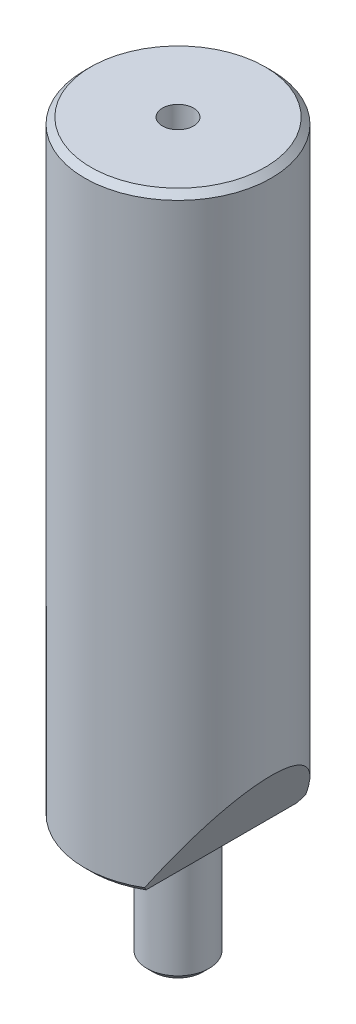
ISO-10303-21;
HEADER;
FILE_DESCRIPTION(('STEP AP214'),'2;1');
FILE_NAME('part.step','',(''),(''),'','','');
FILE_SCHEMA(('AUTOMOTIVE_DESIGN { 1 0 10303 214 1 1 1 1 }'));
ENDSEC;
DATA;
#1=APPLICATION_CONTEXT('core data for automotive mechanical design processes');
#2=APPLICATION_PROTOCOL_DEFINITION('international standard','automotive_design',2000,#1);
#3=PRODUCT_CONTEXT('',#1,'mechanical');
#4=PRODUCT('Part','Part','',(#3));
#5=PRODUCT_RELATED_PRODUCT_CATEGORY('part','',(#4));
#6=PRODUCT_DEFINITION_FORMATION('','',#4);
#7=PRODUCT_DEFINITION_CONTEXT('part definition',#1,'design');
#8=PRODUCT_DEFINITION('design','',#6,#7);
#9=PRODUCT_DEFINITION_SHAPE('','',#8);
#10=(LENGTH_UNIT() NAMED_UNIT(*) SI_UNIT(.MILLI.,.METRE.));
#11=(NAMED_UNIT(*) PLANE_ANGLE_UNIT() SI_UNIT($,.RADIAN.));
#12=(NAMED_UNIT(*) SI_UNIT($,.STERADIAN.) SOLID_ANGLE_UNIT());
#13=UNCERTAINTY_MEASURE_WITH_UNIT(LENGTH_MEASURE(1.E-05),#10,'distance_accuracy_value','');
#14=(GEOMETRIC_REPRESENTATION_CONTEXT(3) GLOBAL_UNCERTAINTY_ASSIGNED_CONTEXT((#13)) GLOBAL_UNIT_ASSIGNED_CONTEXT((#10,
#11,#12)) REPRESENTATION_CONTEXT('',''));
#15=CARTESIAN_POINT('',(0.,0.,0.));
#16=DIRECTION('',(0.,0.,1.));
#17=DIRECTION('',(1.,0.,0.));
#18=AXIS2_PLACEMENT_3D('',#15,#16,#17);
#19=CARTESIAN_POINT('',(0.,-9.49999999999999,0.));
#20=DIRECTION('',(0.,-1.,0.));
#21=DIRECTION('',(0.,0.,-1.));
#22=AXIS2_PLACEMENT_3D('',#19,#20,#21);
#23=PLANE('',#22);
#24=CARTESIAN_POINT('',(0.,-9.50000000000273,0.));
#25=DIRECTION('',(0.,1.,0.));
#26=DIRECTION('',(0.,0.,1.));
#27=AXIS2_PLACEMENT_3D('',#24,#25,#26);
#28=CIRCLE('',#27,2.00000000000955);
#29=CARTESIAN_POINT('',(0.,-9.50000000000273,2.00000000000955));
#30=VERTEX_POINT('',#29);
#31=EDGE_CURVE('E19',#30,#30,#28,.T.);
#32=ORIENTED_EDGE('',*,*,#31,.F.);
#33=EDGE_LOOP('',(#32));
#34=FACE_BOUND('',#33,.T.);
#35=ADVANCED_FACE('F16',(#34),#23,.T.);
#36=CARTESIAN_POINT('',(0.,-9.00000000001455,0.));
#37=DIRECTION('',(0.,1.,0.));
#38=DIRECTION('',(0.,0.,1.));
#39=AXIS2_PLACEMENT_3D('',#36,#37,#38);
#40=CONICAL_SURFACE('',#39,2.49999999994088,0.785398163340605);
#41=CARTESIAN_POINT('',(0.,-9.00000000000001,0.));
#42=DIRECTION('',(0.,-1.,0.));
#43=DIRECTION('',(0.,0.,-1.));
#44=AXIS2_PLACEMENT_3D('',#41,#42,#43);
#45=CIRCLE('',#44,2.5);
#46=CARTESIAN_POINT('',(0.,-9.00000000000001,-2.5));
#47=VERTEX_POINT('',#46);
#48=EDGE_CURVE('E58',#47,#47,#45,.F.);
#49=ORIENTED_EDGE('',*,*,#48,.F.);
#50=EDGE_LOOP('',(#49));
#51=FACE_BOUND('',#50,.T.);
#52=ORIENTED_EDGE('',*,*,#31,.T.);
#53=EDGE_LOOP('',(#52));
#54=FACE_BOUND('',#53,.T.);
#55=ADVANCED_FACE('F51',(#51,#54),#40,.T.);
#56=CARTESIAN_POINT('',(0.,41.9999999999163,0.));
#57=DIRECTION('',(0.,1.,0.));
#58=DIRECTION('',(0.,0.,1.));
#59=AXIS2_PLACEMENT_3D('',#56,#57,#58);
#60=CONICAL_SURFACE('',#59,1.24999999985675,1.02974425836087);
#61=CARTESIAN_POINT('',(0.,41.2489242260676,0.));
#62=VERTEX_POINT('',#61);
#63=VERTEX_LOOP('',#62);
#64=FACE_BOUND('',#63,.T.);
#65=CARTESIAN_POINT('',(0.,42.,0.));
#66=DIRECTION('',(0.,1.,0.));
#67=DIRECTION('',(0.,0.,1.));
#68=AXIS2_PLACEMENT_3D('',#65,#66,#67);
#69=CIRCLE('',#68,1.25);
#70=CARTESIAN_POINT('',(0.,42.,1.25));
#71=VERTEX_POINT('',#70);
#72=EDGE_CURVE('E55',#71,#71,#69,.T.);
#73=ORIENTED_EDGE('',*,*,#72,.T.);
#74=EDGE_LOOP('',(#73));
#75=FACE_BOUND('',#74,.T.);
#76=ADVANCED_FACE('F47',(#64,#75),#60,.F.);
#77=CARTESIAN_POINT('',(0.,0.,0.));
#78=DIRECTION('',(0.,-1.,0.));
#79=DIRECTION('',(0.,0.,-1.));
#80=AXIS2_PLACEMENT_3D('',#77,#78,#79);
#81=CYLINDRICAL_SURFACE('',#80,2.5);
#82=ORIENTED_EDGE('',*,*,#48,.T.);
#83=EDGE_LOOP('',(#82));
#84=FACE_BOUND('',#83,.T.);
#85=CARTESIAN_POINT('',(0.,0.,0.));
#86=DIRECTION('',(0.,-1.,0.));
#87=DIRECTION('',(0.,0.,-1.));
#88=AXIS2_PLACEMENT_3D('',#85,#86,#87);
#89=CIRCLE('',#88,2.5);
#90=CARTESIAN_POINT('',(0.,0.,-2.5));
#91=VERTEX_POINT('',#90);
#92=EDGE_CURVE('E57',#91,#91,#89,.T.);
#93=ORIENTED_EDGE('',*,*,#92,.T.);
#94=EDGE_LOOP('',(#93));
#95=FACE_BOUND('',#94,.T.);
#96=ADVANCED_FACE('F50',(#84,#95),#81,.T.);
#97=CARTESIAN_POINT('',(0.,40.86137043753,0.));
#98=DIRECTION('',(0.,1.,0.));
#99=DIRECTION('',(0.,0.,1.));
#100=AXIS2_PLACEMENT_3D('',#97,#98,#99);
#101=CYLINDRICAL_SURFACE('',#100,1.25);
#102=ORIENTED_EDGE('',*,*,#72,.F.);
#103=EDGE_LOOP('',(#102));
#104=FACE_BOUND('',#103,.T.);
#105=CARTESIAN_POINT('',(0.,49.,0.));
#106=DIRECTION('',(0.,1.,0.));
#107=DIRECTION('',(0.,0.,1.));
#108=AXIS2_PLACEMENT_3D('',#105,#106,#107);
#109=CIRCLE('',#108,1.25);
#110=CARTESIAN_POINT('',(0.,49.,1.25));
#111=VERTEX_POINT('',#110);
#112=EDGE_CURVE('E72',#111,#111,#109,.F.);
#113=ORIENTED_EDGE('',*,*,#112,.F.);
#114=EDGE_LOOP('',(#113));
#115=FACE_BOUND('',#114,.T.);
#116=ADVANCED_FACE('F96',(#104,#115),#101,.F.);
#117=CARTESIAN_POINT('',(0.,0.,0.));
#118=DIRECTION('',(0.,1.,0.));
#119=DIRECTION('',(0.,0.,1.));
#120=AXIS2_PLACEMENT_3D('',#117,#118,#119);
#121=PLANE('',#120);
#122=DIRECTION('',(0.,0.,1.));
#123=VECTOR('',#122,1.);
#124=CARTESIAN_POINT('',(3.49999999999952,0.,9.00000000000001));
#125=LINE('',#124,#123);
#126=CARTESIAN_POINT('',(3.49999999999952,0.,-6.06217782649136));
#127=VERTEX_POINT('',#126);
#128=CARTESIAN_POINT('',(3.49999999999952,0.,6.06217782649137));
#129=VERTEX_POINT('',#128);
#130=EDGE_CURVE('E61',#127,#129,#125,.T.);
#131=ORIENTED_EDGE('',*,*,#130,.T.);
#132=CARTESIAN_POINT('',(0.,0.,0.));
#133=DIRECTION('',(0.,1.,0.));
#134=DIRECTION('',(-1.,0.,0.));
#135=AXIS2_PLACEMENT_3D('',#132,#133,#134);
#136=CIRCLE('',#135,7.);
#137=EDGE_CURVE('E41',#127,#129,#136,.T.);
#138=ORIENTED_EDGE('',*,*,#137,.F.);
#139=EDGE_LOOP('',(#131,#138));
#140=FACE_BOUND('',#139,.T.);
#141=ORIENTED_EDGE('',*,*,#92,.F.);
#142=EDGE_LOOP('',(#141));
#143=FACE_BOUND('',#142,.T.);
#144=ADVANCED_FACE('F93',(#140,#143),#121,.F.);
#145=CARTESIAN_POINT('',(7.50000000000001,6.928203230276,9.00000000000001));
#146=DIRECTION('',(-0.866025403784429,0.500000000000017,0.));
#147=DIRECTION('',(-0.500000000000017,-0.866025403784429,0.));
#148=AXIS2_PLACEMENT_3D('',#145,#146,#147);
#149=PLANE('',#148);
#150=CARTESIAN_POINT('',(0.,-6.06217782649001,0.));
#151=DIRECTION('',(-0.866025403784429,0.500000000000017,0.));
#152=DIRECTION('',(0.500000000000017,0.866025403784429,0.));
#153=AXIS2_PLACEMENT_3D('',#150,#151,#152);
#154=ELLIPSE('',#153,14.9999999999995,7.5);
#155=CARTESIAN_POINT('',(3.78867513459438,0.500000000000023,6.47270737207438));
#156=VERTEX_POINT('',#155);
#157=CARTESIAN_POINT('',(3.78867513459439,0.500000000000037,-6.47270737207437));
#158=VERTEX_POINT('',#157);
#159=EDGE_CURVE('E69',#156,#158,#154,.T.);
#160=ORIENTED_EDGE('',*,*,#159,.F.);
#161=CARTESIAN_POINT('',(3.49999999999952,0.,6.06217782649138));
#162=CARTESIAN_POINT('',(3.54810665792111,0.0833231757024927,6.13061591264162));
#163=CARTESIAN_POINT('',(3.59621624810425,0.166651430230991,6.19904575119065));
#164=CARTESIAN_POINT('',(3.69244129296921,0.333318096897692,6.33588893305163));
#165=CARTESIAN_POINT('',(3.74055674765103,0.41665650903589,6.40430227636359));
#166=CARTESIAN_POINT('',(3.7886751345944,0.500000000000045,6.47270737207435));
#167=B_SPLINE_CURVE_WITH_KNOTS('',3,(#161,#162,#163,#164,#165,#166),.UNSPECIFIED.,.F.,.F.,(4,2,
4),(0.,0.354213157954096,0.708426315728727),.UNSPECIFIED.);
#168=EDGE_CURVE('E82',#129,#156,#167,.T.);
#169=ORIENTED_EDGE('',*,*,#168,.F.);
#170=ORIENTED_EDGE('',*,*,#130,.F.);
#171=CARTESIAN_POINT('',(3.7886751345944,0.500000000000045,-6.47270737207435));
#172=CARTESIAN_POINT('',(3.74055674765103,0.416656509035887,-6.40430227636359));
#173=CARTESIAN_POINT('',(3.6924412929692,0.333318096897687,-6.33588893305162));
#174=CARTESIAN_POINT('',(3.59621624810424,0.166651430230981,-6.19904575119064));
#175=CARTESIAN_POINT('',(3.54810665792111,0.0833231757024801,-6.13061591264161));
#176=CARTESIAN_POINT('',(3.49999999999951,0.,-6.06217782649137));
#177=B_SPLINE_CURVE_WITH_KNOTS('',3,(#171,#172,#173,#174,#175,#176),.UNSPECIFIED.,.F.,.F.,(4,2,
4),(0.,0.354213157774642,0.708426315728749),.UNSPECIFIED.);
#178=EDGE_CURVE('E75',#158,#127,#177,.T.);
#179=ORIENTED_EDGE('',*,*,#178,.F.);
#180=EDGE_LOOP('',(#160,#169,#170,#179));
#181=FACE_BOUND('',#180,.T.);
#182=ADVANCED_FACE('F87',(#181),#149,.F.);
#183=CARTESIAN_POINT('',(0.,49.,0.));
#184=DIRECTION('',(0.,1.,0.));
#185=DIRECTION('',(0.,0.,1.));
#186=AXIS2_PLACEMENT_3D('',#183,#184,#185);
#187=PLANE('',#186);
#188=CARTESIAN_POINT('',(0.,49.,0.));
#189=DIRECTION('',(0.,-1.,0.));
#190=DIRECTION('',(0.,0.,-1.));
#191=AXIS2_PLACEMENT_3D('',#188,#189,#190);
#192=CIRCLE('',#191,7.00000000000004);
#193=CARTESIAN_POINT('',(0.,49.,-7.00000000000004));
#194=VERTEX_POINT('',#193);
#195=EDGE_CURVE('E66',#194,#194,#192,.T.);
#196=ORIENTED_EDGE('',*,*,#195,.F.);
#197=EDGE_LOOP('',(#196));
#198=FACE_BOUND('',#197,.T.);
#199=ORIENTED_EDGE('',*,*,#112,.T.);
#200=EDGE_LOOP('',(#199));
#201=FACE_BOUND('',#200,.T.);
#202=ADVANCED_FACE('F123',(#198,#201),#187,.T.);
#203=CARTESIAN_POINT('',(0.,0.499999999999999,0.));
#204=DIRECTION('',(0.,1.,0.));
#205=DIRECTION('',(-1.,0.,0.));
#206=AXIS2_PLACEMENT_3D('',#203,#204,#205);
#207=CONICAL_SURFACE('',#206,7.49999999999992,0.7853981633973);
#208=ORIENTED_EDGE('',*,*,#137,.T.);
#209=ORIENTED_EDGE('',*,*,#168,.T.);
#210=CARTESIAN_POINT('',(0.,0.5,0.));
#211=DIRECTION('',(0.,1.,0.));
#212=DIRECTION('',(0.,0.,1.));
#213=AXIS2_PLACEMENT_3D('',#210,#211,#212);
#214=CIRCLE('',#213,7.5);
#215=EDGE_CURVE('E25',#158,#156,#214,.T.);
#216=ORIENTED_EDGE('',*,*,#215,.F.);
#217=ORIENTED_EDGE('',*,*,#178,.T.);
#218=EDGE_LOOP('',(#208,#209,#216,#217));
#219=FACE_BOUND('',#218,.T.);
#220=ADVANCED_FACE('F117',(#219),#207,.T.);
#221=CARTESIAN_POINT('',(0.,48.5,0.));
#222=DIRECTION('',(0.,-1.,0.));
#223=DIRECTION('',(0.,0.,-1.));
#224=AXIS2_PLACEMENT_3D('',#221,#222,#223);
#225=CONICAL_SURFACE('',#224,7.49999999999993,0.7853981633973);
#226=CARTESIAN_POINT('',(0.,48.5,0.));
#227=DIRECTION('',(0.,1.,0.));
#228=DIRECTION('',(0.,0.,1.));
#229=AXIS2_PLACEMENT_3D('',#226,#227,#228);
#230=CIRCLE('',#229,7.5);
#231=CARTESIAN_POINT('',(0.,48.5,7.5));
#232=VERTEX_POINT('',#231);
#233=EDGE_CURVE('E11',#232,#232,#230,.F.);
#234=ORIENTED_EDGE('',*,*,#233,.F.);
#235=EDGE_LOOP('',(#234));
#236=FACE_BOUND('',#235,.T.);
#237=ORIENTED_EDGE('',*,*,#195,.T.);
#238=EDGE_LOOP('',(#237));
#239=FACE_BOUND('',#238,.T.);
#240=ADVANCED_FACE('F112',(#236,#239),#225,.T.);
#241=CARTESIAN_POINT('',(0.,0.,0.));
#242=DIRECTION('',(0.,1.,0.));
#243=DIRECTION('',(0.,0.,1.));
#244=AXIS2_PLACEMENT_3D('',#241,#242,#243);
#245=CYLINDRICAL_SURFACE('',#244,7.5);
#246=ORIENTED_EDGE('',*,*,#159,.T.);
#247=ORIENTED_EDGE('',*,*,#215,.T.);
#248=EDGE_LOOP('',(#246,#247));
#249=FACE_BOUND('',#248,.T.);
#250=ORIENTED_EDGE('',*,*,#233,.T.);
#251=EDGE_LOOP('',(#250));
#252=FACE_BOUND('',#251,.T.);
#253=ADVANCED_FACE('F110',(#249,#252),#245,.T.);
#254=CLOSED_SHELL('',(#35,#55,#76,#96,#116,#144,#182,#202,#220,#240,#253));
#255=MANIFOLD_SOLID_BREP('B1',#254);
#256=ADVANCED_BREP_SHAPE_REPRESENTATION('',(#18,#255),#14);
#257=SHAPE_DEFINITION_REPRESENTATION(#9,#256);
ENDSEC;
END-ISO-10303-21;
